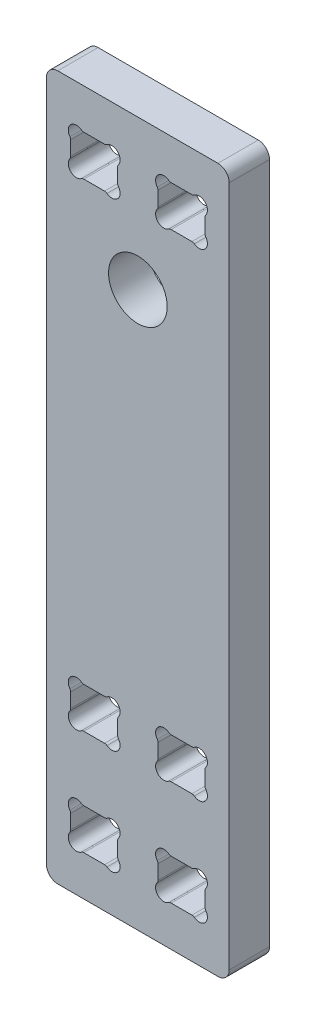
from build123d import *

# Parameters (mm, degrees)
BOSS_EXTRU_2_DEPTH = 25
CONG_1_R           = 7


with BuildPart() as part:
    # Esquisse2 → Boss.-Extru.2 (new body)
    with BuildSketch(Plane.XY):
        with BuildLine():
            Line((56.666666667, 107.428362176), (56.666666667, -218.383701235))
            Line((56.666666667, -218.383701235), (0, -218.383701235))
            Line((0, -218.383701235), (0, 218.383701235))
            Line((0, 218.383701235), (56.666666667, 218.383701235))
            Line((56.666666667, 218.383701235), (56.666666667, 143.783701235))
            ThreePointArc((56.666666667, 143.783701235), (38.488997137, 125.606031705), (56.666666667, 107.428362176))
        make_face()
        with BuildLine():
            Line((36.035626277, -193.483701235), (23.131040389, -193.483701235))
            ThreePointArc((23.131040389, -193.483701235), (22.347325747, -193.609719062), (21.642620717, -193.975068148))
            ThreePointArc((21.642620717, -193.975068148), (15, -193.483701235), (14.508633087, -186.841080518))
            ThreePointArc((14.508633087, -186.841080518), (14.873982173, -186.136375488), (15, -185.352660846))
            Line((15, -185.352660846), (15, -176.414741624))
            ThreePointArc((15, -176.414741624), (14.873982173, -175.631026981), (14.508633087, -174.926321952))
            ThreePointArc((14.508633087, -174.926321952), (15, -168.283701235), (21.642620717, -167.792334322))
            ThreePointArc((21.642620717, -167.792334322), (22.347325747, -168.157683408), (23.131040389, -168.283701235))
            Line((23.131040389, -168.283701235), (36.035626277, -168.283701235))
            ThreePointArc((36.035626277, -168.283701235), (36.81934092, -168.157683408), (37.52404595, -167.792334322))
            ThreePointArc((37.52404595, -167.792334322), (44.166666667, -168.283701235), (44.65803358, -174.926321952))
            ThreePointArc((44.65803358, -174.926321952), (44.292684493, -175.631026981), (44.166666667, -176.414741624))
            Line((44.166666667, -176.414741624), (44.166666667, -185.352660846))
            ThreePointArc((44.166666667, -185.352660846), (44.292684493, -186.136375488), (44.65803358, -186.841080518))
            ThreePointArc((44.65803358, -186.841080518), (44.166666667, -193.483701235), (37.52404595, -193.975068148))
            ThreePointArc((37.52404595, -193.975068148), (36.81934092, -193.609719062), (36.035626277, -193.483701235))
        make_face(mode=Mode.SUBTRACT)
        with BuildLine():
            Line((44.166666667, 176.414741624), (44.166666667, 185.352660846))
            ThreePointArc((44.166666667, 185.352660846), (44.292684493, 186.136375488), (44.65803358, 186.841080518))
            ThreePointArc((44.65803358, 186.841080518), (44.166666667, 193.483701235), (37.52404595, 193.975068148))
            ThreePointArc((37.52404595, 193.975068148), (36.81934092, 193.609719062), (36.035626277, 193.483701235))
            Line((36.035626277, 193.483701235), (23.131040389, 193.483701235))
            ThreePointArc((23.131040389, 193.483701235), (22.347325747, 193.609719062), (21.642620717, 193.975068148))
            ThreePointArc((21.642620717, 193.975068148), (15, 193.483701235), (14.508633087, 186.841080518))
            ThreePointArc((14.508633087, 186.841080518), (14.873982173, 186.136375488), (15, 185.352660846))
            Line((15, 185.352660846), (15, 176.414741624))
            ThreePointArc((15, 176.414741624), (14.873982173, 175.631026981), (14.508633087, 174.926321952))
            ThreePointArc((14.508633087, 174.926321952), (15, 168.283701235), (21.642620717, 167.792334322))
            ThreePointArc((21.642620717, 167.792334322), (22.347325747, 168.157683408), (23.131040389, 168.283701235))
            Line((23.131040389, 168.283701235), (36.035626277, 168.283701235))
            ThreePointArc((36.035626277, 168.283701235), (36.81934092, 168.157683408), (37.52404595, 167.792334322))
            ThreePointArc((37.52404595, 167.792334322), (44.166666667, 168.283701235), (44.65803358, 174.926321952))
            ThreePointArc((44.65803358, 174.926321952), (44.292684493, 175.631026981), (44.166666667, 176.414741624))
        make_face(mode=Mode.SUBTRACT)
        with BuildLine():
            Line((44.166666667, -120.152660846), (44.166666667, -111.214741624))
            ThreePointArc((44.166666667, -111.214741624), (44.292684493, -110.431026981), (44.65803358, -109.726321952))
            ThreePointArc((44.65803358, -109.726321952), (44.166666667, -103.083701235), (37.52404595, -102.592334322))
            ThreePointArc((37.52404595, -102.592334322), (36.81934092, -102.957683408), (36.035626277, -103.083701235))
            Line((36.035626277, -103.083701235), (23.131040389, -103.083701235))
            ThreePointArc((23.131040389, -103.083701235), (22.347325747, -102.957683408), (21.642620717, -102.592334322))
            ThreePointArc((21.642620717, -102.592334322), (15, -103.083701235), (14.508633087, -109.726321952))
            ThreePointArc((14.508633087, -109.726321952), (14.873982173, -110.431026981), (15, -111.214741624))
            Line((15, -111.214741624), (15, -120.152660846))
            ThreePointArc((15, -120.152660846), (14.873982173, -120.936375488), (14.508633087, -121.641080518))
            ThreePointArc((14.508633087, -121.641080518), (15, -128.283701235), (21.642620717, -128.775068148))
            ThreePointArc((21.642620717, -128.775068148), (22.347325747, -128.409719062), (23.131040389, -128.283701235))
            Line((23.131040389, -128.283701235), (36.035626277, -128.283701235))
            ThreePointArc((36.035626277, -128.283701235), (36.81934092, -128.409719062), (37.52404595, -128.775068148))
            ThreePointArc((37.52404595, -128.775068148), (44.166666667, -128.283701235), (44.65803358, -121.641080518))
            ThreePointArc((44.65803358, -121.641080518), (44.292684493, -120.936375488), (44.166666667, -120.152660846))
        make_face(mode=Mode.SUBTRACT)
    extrude(amount=BOSS_EXTRU_2_DEPTH)

    # Cong_1
    cong_1_edges = [part.edges().sort_by_distance(p)[0] for p in [
        (0, 218.383701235, 12.5),
        (0, -218.383701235, 12.5),
    ]]
    fillet(cong_1_edges, radius=CONG_1_R)

    # Mirror1: part across plane


with BuildPart() as part_1:
    add(part.part)
    add(part.part.mirror(Plane(origin=(56.666666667, 107.428362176, 25), x_dir=(0, 0, 1), z_dir=(-1, 0, 0))))


solid = part_1.part
